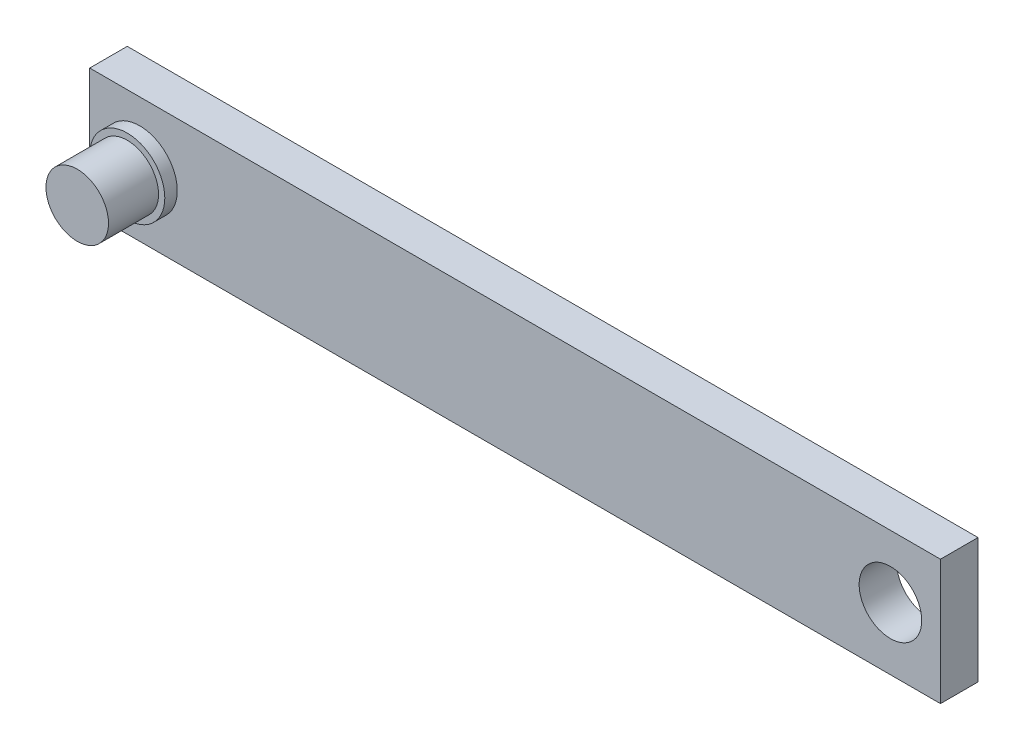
from build123d import *

# Parameters (mm, degrees)
SKETCH_1_W          = 680
SKETCH_1_H          = 100
EXTRUDE_1_DEPTH     = 30
SKETCH_2_R          = 30
EXTRUDE_2_DEPTH     = 10
SKETCH_3_R          = 25
EXTRUDE_3_DEPTH     = 40
SKETCH_4_R          = 25
CUT_EXTRUDE_4_DEPTH = 690.129886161


with BuildPart() as part:
    # Sketch 1 → Extrude 1 (new body)
    with BuildSketch(Plane.XY):
        with Locations((340, 50)):
            Rectangle(SKETCH_1_W, SKETCH_1_H)
    extrude(amount=EXTRUDE_1_DEPTH)

    # Sketch 2 → Extrude 2 (add)
    with BuildSketch(Plane.XY.offset(30)):
        with Locations(Location((40, 50, 0), (0, 0, 180))):
            Circle(SKETCH_2_R)
    extrude(amount=EXTRUDE_2_DEPTH)

    # Sketch 3 → Extrude 3 (add)
    with BuildSketch(Plane.XY.offset(40)):
        with Locations((40, 50)):
            Circle(SKETCH_3_R)
    extrude(amount=EXTRUDE_3_DEPTH)

    # Sketch 4 → Cut-Extrude 4 (cut, through all)
    with BuildSketch(Plane.XY.offset(30)):
        with Locations((640, 50)):
            Circle(SKETCH_4_R)
    extrude(amount=-CUT_EXTRUDE_4_DEPTH, mode=Mode.SUBTRACT)


solid = part.part
